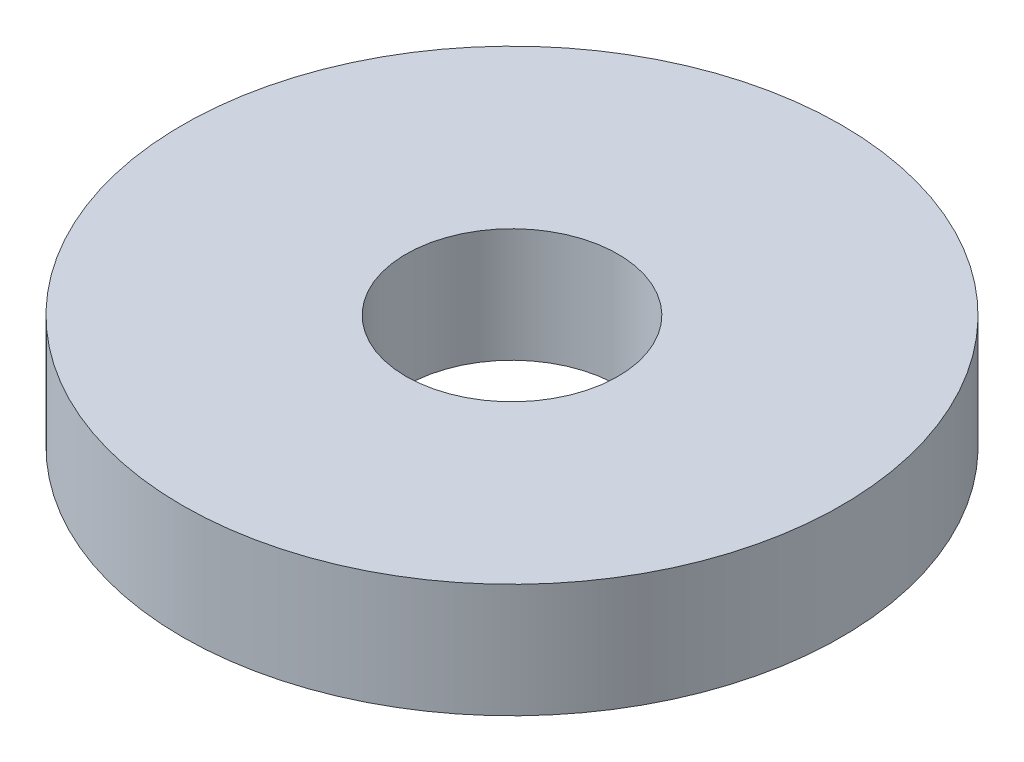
ISO-10303-21;
HEADER;
FILE_DESCRIPTION(('STEP AP214'),'2;1');
FILE_NAME('part.step','',(''),(''),'','','');
FILE_SCHEMA(('AUTOMOTIVE_DESIGN { 1 0 10303 214 1 1 1 1 }'));
ENDSEC;
DATA;
#1=APPLICATION_CONTEXT('core data for automotive mechanical design processes');
#2=APPLICATION_PROTOCOL_DEFINITION('international standard','automotive_design',2000,#1);
#3=PRODUCT_CONTEXT('',#1,'mechanical');
#4=PRODUCT('Part','Part','',(#3));
#5=PRODUCT_RELATED_PRODUCT_CATEGORY('part','',(#4));
#6=PRODUCT_DEFINITION_FORMATION('','',#4);
#7=PRODUCT_DEFINITION_CONTEXT('part definition',#1,'design');
#8=PRODUCT_DEFINITION('design','',#6,#7);
#9=PRODUCT_DEFINITION_SHAPE('','',#8);
#10=(LENGTH_UNIT() NAMED_UNIT(*) SI_UNIT(.MILLI.,.METRE.));
#11=(NAMED_UNIT(*) PLANE_ANGLE_UNIT() SI_UNIT($,.RADIAN.));
#12=(NAMED_UNIT(*) SI_UNIT($,.STERADIAN.) SOLID_ANGLE_UNIT());
#13=UNCERTAINTY_MEASURE_WITH_UNIT(LENGTH_MEASURE(1.E-05),#10,'distance_accuracy_value','');
#14=(GEOMETRIC_REPRESENTATION_CONTEXT(3) GLOBAL_UNCERTAINTY_ASSIGNED_CONTEXT((#13)) GLOBAL_UNIT_ASSIGNED_CONTEXT((#10,
#11,#12)) REPRESENTATION_CONTEXT('',''));
#15=CARTESIAN_POINT('',(0.,0.,0.));
#16=DIRECTION('',(0.,0.,1.));
#17=DIRECTION('',(1.,0.,0.));
#18=AXIS2_PLACEMENT_3D('',#15,#16,#17);
#19=CARTESIAN_POINT('',(0.,2.7432,0.));
#20=DIRECTION('',(0.,1.,0.));
#21=DIRECTION('',(0.,0.,1.));
#22=AXIS2_PLACEMENT_3D('',#19,#20,#21);
#23=PLANE('',#22);
#24=CARTESIAN_POINT('',(0.,2.7432,0.));
#25=DIRECTION('',(0.,1.,0.));
#26=DIRECTION('',(0.,0.,1.));
#27=AXIS2_PLACEMENT_3D('',#24,#25,#26);
#28=CIRCLE('',#27,7.9375);
#29=CARTESIAN_POINT('',(0.,2.7432,7.9375));
#30=VERTEX_POINT('',#29);
#31=EDGE_CURVE('E10',#30,#30,#28,.T.);
#32=ORIENTED_EDGE('',*,*,#31,.T.);
#33=EDGE_LOOP('',(#32));
#34=FACE_BOUND('',#33,.T.);
#35=CARTESIAN_POINT('',(0.,2.7432,0.));
#36=DIRECTION('',(0.,1.,0.));
#37=DIRECTION('',(0.,0.,1.));
#38=AXIS2_PLACEMENT_3D('',#35,#36,#37);
#39=CIRCLE('',#38,2.5527);
#40=CARTESIAN_POINT('',(0.,2.7432,2.5527));
#41=VERTEX_POINT('',#40);
#42=EDGE_CURVE('E44',#41,#41,#39,.T.);
#43=ORIENTED_EDGE('',*,*,#42,.F.);
#44=EDGE_LOOP('',(#43));
#45=FACE_BOUND('',#44,.T.);
#46=ADVANCED_FACE('F33',(#34,#45),#23,.T.);
#47=CARTESIAN_POINT('',(0.,0.,0.));
#48=DIRECTION('',(0.,1.,0.));
#49=DIRECTION('',(0.,0.,1.));
#50=AXIS2_PLACEMENT_3D('',#47,#48,#49);
#51=PLANE('',#50);
#52=CARTESIAN_POINT('',(0.,0.,0.));
#53=DIRECTION('',(0.,1.,0.));
#54=DIRECTION('',(0.,0.,1.));
#55=AXIS2_PLACEMENT_3D('',#52,#53,#54);
#56=CIRCLE('',#55,7.9375);
#57=CARTESIAN_POINT('',(0.,0.,7.9375));
#58=VERTEX_POINT('',#57);
#59=EDGE_CURVE('E37',#58,#58,#56,.T.);
#60=ORIENTED_EDGE('',*,*,#59,.F.);
#61=EDGE_LOOP('',(#60));
#62=FACE_BOUND('',#61,.T.);
#63=CARTESIAN_POINT('',(0.,0.,0.));
#64=DIRECTION('',(0.,1.,0.));
#65=DIRECTION('',(0.,0.,1.));
#66=AXIS2_PLACEMENT_3D('',#63,#64,#65);
#67=CIRCLE('',#66,2.5527);
#68=CARTESIAN_POINT('',(0.,0.,2.5527));
#69=VERTEX_POINT('',#68);
#70=EDGE_CURVE('E46',#69,#69,#67,.T.);
#71=ORIENTED_EDGE('',*,*,#70,.T.);
#72=EDGE_LOOP('',(#71));
#73=FACE_BOUND('',#72,.T.);
#74=ADVANCED_FACE('F56',(#62,#73),#51,.F.);
#75=CARTESIAN_POINT('',(0.,2.7432,0.));
#76=DIRECTION('',(0.,-1.,0.));
#77=DIRECTION('',(0.,0.,-1.));
#78=AXIS2_PLACEMENT_3D('',#75,#76,#77);
#79=CYLINDRICAL_SURFACE('',#78,7.9375);
#80=ORIENTED_EDGE('',*,*,#31,.F.);
#81=EDGE_LOOP('',(#80));
#82=FACE_BOUND('',#81,.T.);
#83=ORIENTED_EDGE('',*,*,#59,.T.);
#84=EDGE_LOOP('',(#83));
#85=FACE_BOUND('',#84,.T.);
#86=ADVANCED_FACE('F35',(#82,#85),#79,.T.);
#87=CARTESIAN_POINT('',(0.,2.7432,0.));
#88=DIRECTION('',(0.,-1.,0.));
#89=DIRECTION('',(0.,0.,-1.));
#90=AXIS2_PLACEMENT_3D('',#87,#88,#89);
#91=CYLINDRICAL_SURFACE('',#90,2.5527);
#92=ORIENTED_EDGE('',*,*,#42,.T.);
#93=EDGE_LOOP('',(#92));
#94=FACE_BOUND('',#93,.T.);
#95=ORIENTED_EDGE('',*,*,#70,.F.);
#96=EDGE_LOOP('',(#95));
#97=FACE_BOUND('',#96,.T.);
#98=ADVANCED_FACE('F52',(#94,#97),#91,.F.);
#99=CLOSED_SHELL('',(#46,#74,#86,#98));
#100=MANIFOLD_SOLID_BREP('B2',#99);
#101=ADVANCED_BREP_SHAPE_REPRESENTATION('',(#18,#100),#14);
#102=SHAPE_DEFINITION_REPRESENTATION(#9,#101);
ENDSEC;
END-ISO-10303-21;
